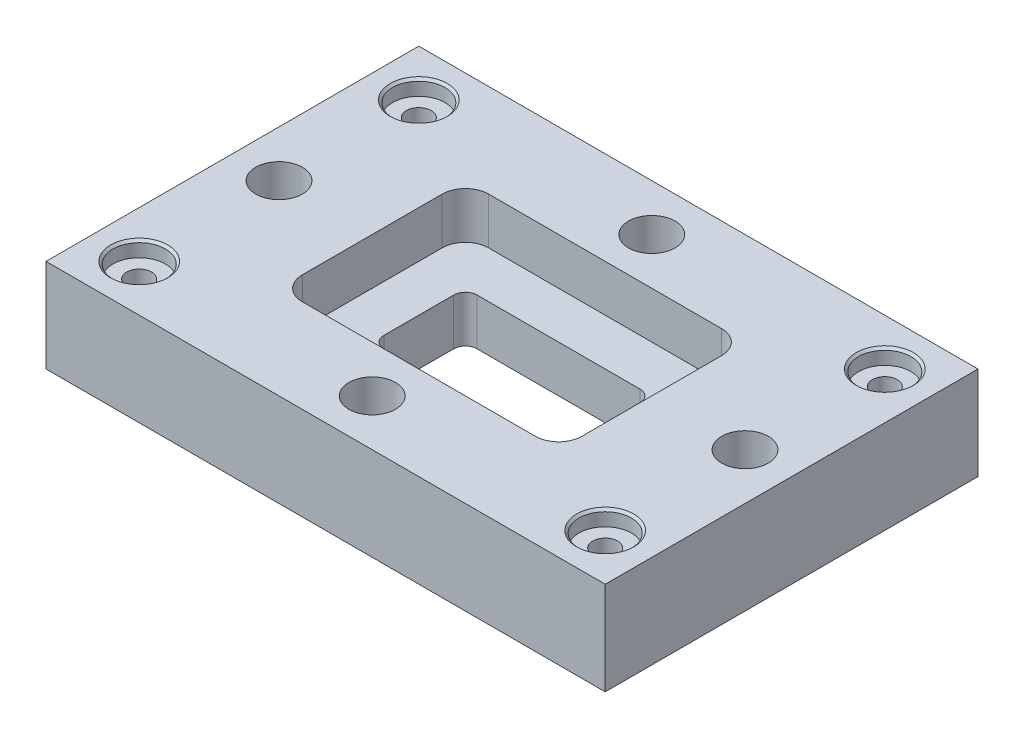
ISO-10303-21;
HEADER;
FILE_DESCRIPTION(('STEP AP214'),'2;1');
FILE_NAME('part.step','',(''),(''),'','','');
FILE_SCHEMA(('AUTOMOTIVE_DESIGN { 1 0 10303 214 1 1 1 1 }'));
ENDSEC;
DATA;
#1=APPLICATION_CONTEXT('core data for automotive mechanical design processes');
#2=APPLICATION_PROTOCOL_DEFINITION('international standard','automotive_design',2000,#1);
#3=PRODUCT_CONTEXT('',#1,'mechanical');
#4=PRODUCT('Part','Part','',(#3));
#5=PRODUCT_RELATED_PRODUCT_CATEGORY('part','',(#4));
#6=PRODUCT_DEFINITION_FORMATION('','',#4);
#7=PRODUCT_DEFINITION_CONTEXT('part definition',#1,'design');
#8=PRODUCT_DEFINITION('design','',#6,#7);
#9=PRODUCT_DEFINITION_SHAPE('','',#8);
#10=(LENGTH_UNIT() NAMED_UNIT(*) SI_UNIT(.MILLI.,.METRE.));
#11=(NAMED_UNIT(*) PLANE_ANGLE_UNIT() SI_UNIT($,.RADIAN.));
#12=(NAMED_UNIT(*) SI_UNIT($,.STERADIAN.) SOLID_ANGLE_UNIT());
#13=UNCERTAINTY_MEASURE_WITH_UNIT(LENGTH_MEASURE(1.E-05),#10,'distance_accuracy_value','');
#14=(GEOMETRIC_REPRESENTATION_CONTEXT(3) GLOBAL_UNCERTAINTY_ASSIGNED_CONTEXT((#13)) GLOBAL_UNIT_ASSIGNED_CONTEXT((#10,
#11,#12)) REPRESENTATION_CONTEXT('',''));
#15=CARTESIAN_POINT('',(0.,0.,0.));
#16=DIRECTION('',(0.,0.,1.));
#17=DIRECTION('',(1.,0.,0.));
#18=AXIS2_PLACEMENT_3D('',#15,#16,#17);
#19=CARTESIAN_POINT('',(0.,12.7,0.));
#20=DIRECTION('',(0.,-1.,0.));
#21=DIRECTION('',(0.,0.,-1.));
#22=AXIS2_PLACEMENT_3D('',#19,#20,#21);
#23=PLANE('',#22);
#24=DIRECTION('',(1.,0.,0.));
#25=VECTOR('',#24,1.);
#26=CARTESIAN_POINT('',(-38.1,12.7,25.4));
#27=LINE('',#26,#25);
#28=CARTESIAN_POINT('',(-31.75,12.7,25.4));
#29=VERTEX_POINT('',#28);
#30=CARTESIAN_POINT('',(31.75,12.7,25.4));
#31=VERTEX_POINT('',#30);
#32=EDGE_CURVE('E260',#29,#31,#27,.T.);
#33=ORIENTED_EDGE('',*,*,#32,.T.);
#34=CARTESIAN_POINT('',(31.75,12.7,19.05));
#35=DIRECTION('',(0.,-1.,0.));
#36=DIRECTION('',(0.,0.,-1.));
#37=AXIS2_PLACEMENT_3D('',#34,#35,#36);
#38=CIRCLE('',#37,6.35);
#39=CARTESIAN_POINT('',(38.1,12.7,19.05));
#40=VERTEX_POINT('',#39);
#41=EDGE_CURVE('E404',#31,#40,#38,.F.);
#42=ORIENTED_EDGE('',*,*,#41,.T.);
#43=DIRECTION('',(0.,0.,-1.));
#44=VECTOR('',#43,1.);
#45=CARTESIAN_POINT('',(38.1,12.7,25.4));
#46=LINE('',#45,#44);
#47=CARTESIAN_POINT('',(38.1,12.7,-19.05));
#48=VERTEX_POINT('',#47);
#49=EDGE_CURVE('E250',#40,#48,#46,.T.);
#50=ORIENTED_EDGE('',*,*,#49,.T.);
#51=CARTESIAN_POINT('',(31.75,12.7,-19.05));
#52=DIRECTION('',(0.,-1.,0.));
#53=DIRECTION('',(0.,0.,-1.));
#54=AXIS2_PLACEMENT_3D('',#51,#52,#53);
#55=CIRCLE('',#54,6.35);
#56=CARTESIAN_POINT('',(31.75,12.7,-25.4));
#57=VERTEX_POINT('',#56);
#58=EDGE_CURVE('E400',#48,#57,#55,.F.);
#59=ORIENTED_EDGE('',*,*,#58,.T.);
#60=DIRECTION('',(-1.,0.,0.));
#61=VECTOR('',#60,1.);
#62=CARTESIAN_POINT('',(-38.1,12.7,-25.4));
#63=LINE('',#62,#61);
#64=CARTESIAN_POINT('',(-31.75,12.7,-25.4));
#65=VERTEX_POINT('',#64);
#66=EDGE_CURVE('E253',#57,#65,#63,.T.);
#67=ORIENTED_EDGE('',*,*,#66,.T.);
#68=CARTESIAN_POINT('',(-31.75,12.7,-19.05));
#69=DIRECTION('',(0.,-1.,0.));
#70=DIRECTION('',(0.,0.,-1.));
#71=AXIS2_PLACEMENT_3D('',#68,#69,#70);
#72=CIRCLE('',#71,6.35);
#73=CARTESIAN_POINT('',(-38.1,12.7,-19.05));
#74=VERTEX_POINT('',#73);
#75=EDGE_CURVE('E398',#65,#74,#72,.F.);
#76=ORIENTED_EDGE('',*,*,#75,.T.);
#77=DIRECTION('',(0.,0.,1.));
#78=VECTOR('',#77,1.);
#79=CARTESIAN_POINT('',(-38.1,12.7,25.4));
#80=LINE('',#79,#78);
#81=CARTESIAN_POINT('',(-38.1,12.7,19.05));
#82=VERTEX_POINT('',#81);
#83=EDGE_CURVE('E257',#74,#82,#80,.T.);
#84=ORIENTED_EDGE('',*,*,#83,.T.);
#85=CARTESIAN_POINT('',(-31.75,12.7,19.05));
#86=DIRECTION('',(0.,-1.,0.));
#87=DIRECTION('',(0.,0.,-1.));
#88=AXIS2_PLACEMENT_3D('',#85,#86,#87);
#89=CIRCLE('',#88,6.35);
#90=EDGE_CURVE('E402',#82,#29,#89,.F.);
#91=ORIENTED_EDGE('',*,*,#90,.T.);
#92=EDGE_LOOP('',(#33,#42,#50,#59,#67,#76,#84,#91));
#93=FACE_BOUND('',#92,.T.);
#94=CARTESIAN_POINT('',(-22.225,12.7,-9.525));
#95=DIRECTION('',(0.,1.,0.));
#96=DIRECTION('',(0.,0.,-1.));
#97=AXIS2_PLACEMENT_3D('',#94,#95,#96);
#98=CIRCLE('',#97,3.175);
#99=CARTESIAN_POINT('',(-22.225,12.7,-12.7));
#100=VERTEX_POINT('',#99);
#101=CARTESIAN_POINT('',(-25.4,12.7,-9.52499999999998));
#102=VERTEX_POINT('',#101);
#103=EDGE_CURVE('E186',#100,#102,#98,.T.);
#104=ORIENTED_EDGE('',*,*,#103,.F.);
#105=DIRECTION('',(-1.,0.,0.));
#106=VECTOR('',#105,1.);
#107=CARTESIAN_POINT('',(-22.225,12.7,-12.7));
#108=LINE('',#107,#106);
#109=CARTESIAN_POINT('',(22.225,12.7,-12.7));
#110=VERTEX_POINT('',#109);
#111=EDGE_CURVE('E202',#110,#100,#108,.T.);
#112=ORIENTED_EDGE('',*,*,#111,.F.);
#113=CARTESIAN_POINT('',(22.225,12.7,-9.525));
#114=DIRECTION('',(0.,1.,0.));
#115=DIRECTION('',(0.,0.,-1.));
#116=AXIS2_PLACEMENT_3D('',#113,#114,#115);
#117=CIRCLE('',#116,3.175);
#118=CARTESIAN_POINT('',(25.4,12.7,-9.52499999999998));
#119=VERTEX_POINT('',#118);
#120=EDGE_CURVE('E57',#119,#110,#117,.T.);
#121=ORIENTED_EDGE('',*,*,#120,.F.);
#122=DIRECTION('',(0.,0.,-1.));
#123=VECTOR('',#122,1.);
#124=CARTESIAN_POINT('',(25.4,12.7,9.52499999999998));
#125=LINE('',#124,#123);
#126=CARTESIAN_POINT('',(25.4,12.7,9.52499999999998));
#127=VERTEX_POINT('',#126);
#128=EDGE_CURVE('E232',#127,#119,#125,.T.);
#129=ORIENTED_EDGE('',*,*,#128,.F.);
#130=CARTESIAN_POINT('',(22.225,12.7,9.525));
#131=DIRECTION('',(0.,1.,0.));
#132=DIRECTION('',(0.,0.,1.));
#133=AXIS2_PLACEMENT_3D('',#130,#131,#132);
#134=CIRCLE('',#133,3.175);
#135=CARTESIAN_POINT('',(22.225,12.7,12.7));
#136=VERTEX_POINT('',#135);
#137=EDGE_CURVE('E229',#136,#127,#134,.T.);
#138=ORIENTED_EDGE('',*,*,#137,.F.);
#139=DIRECTION('',(1.,0.,0.));
#140=VECTOR('',#139,1.);
#141=CARTESIAN_POINT('',(-22.225,12.7,12.7));
#142=LINE('',#141,#140);
#143=CARTESIAN_POINT('',(-22.225,12.7,12.7));
#144=VERTEX_POINT('',#143);
#145=EDGE_CURVE('E226',#144,#136,#142,.T.);
#146=ORIENTED_EDGE('',*,*,#145,.F.);
#147=CARTESIAN_POINT('',(-22.225,12.7,9.525));
#148=DIRECTION('',(0.,1.,0.));
#149=DIRECTION('',(0.,0.,-1.));
#150=AXIS2_PLACEMENT_3D('',#147,#148,#149);
#151=CIRCLE('',#150,3.175);
#152=CARTESIAN_POINT('',(-25.4,12.7,9.52499999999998));
#153=VERTEX_POINT('',#152);
#154=EDGE_CURVE('E223',#153,#144,#151,.T.);
#155=ORIENTED_EDGE('',*,*,#154,.F.);
#156=DIRECTION('',(0.,0.,1.));
#157=VECTOR('',#156,1.);
#158=CARTESIAN_POINT('',(-25.4,12.7,9.52499999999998));
#159=LINE('',#158,#157);
#160=EDGE_CURVE('E221',#102,#153,#159,.T.);
#161=ORIENTED_EDGE('',*,*,#160,.F.);
#162=EDGE_LOOP('',(#104,#112,#121,#129,#138,#146,#155,#161));
#163=FACE_BOUND('',#162,.T.);
#164=ADVANCED_FACE('F42',(#93,#163),#23,.F.);
#165=CARTESIAN_POINT('',(0.,25.4,0.));
#166=DIRECTION('',(0.,-1.,0.));
#167=DIRECTION('',(0.,0.,-1.));
#168=AXIS2_PLACEMENT_3D('',#165,#166,#167);
#169=PLANE('',#168);
#170=DIRECTION('',(-1.,0.,0.));
#171=VECTOR('',#170,1.);
#172=CARTESIAN_POINT('',(-38.1,25.4,-25.4));
#173=LINE('',#172,#171);
#174=CARTESIAN_POINT('',(31.75,25.4,-25.4));
#175=VERTEX_POINT('',#174);
#176=CARTESIAN_POINT('',(-31.75,25.4,-25.4));
#177=VERTEX_POINT('',#176);
#178=EDGE_CURVE('E266',#175,#177,#173,.T.);
#179=ORIENTED_EDGE('',*,*,#178,.F.);
#180=CARTESIAN_POINT('',(31.75,25.4,-19.05));
#181=DIRECTION('',(0.,-1.,0.));
#182=DIRECTION('',(0.,0.,-1.));
#183=AXIS2_PLACEMENT_3D('',#180,#181,#182);
#184=CIRCLE('',#183,6.35);
#185=CARTESIAN_POINT('',(38.1,25.4,-19.05));
#186=VERTEX_POINT('',#185);
#187=EDGE_CURVE('E50',#175,#186,#184,.T.);
#188=ORIENTED_EDGE('',*,*,#187,.T.);
#189=DIRECTION('',(0.,0.,-1.));
#190=VECTOR('',#189,1.);
#191=CARTESIAN_POINT('',(38.1,25.4,25.4));
#192=LINE('',#191,#190);
#193=CARTESIAN_POINT('',(38.1,25.4,19.05));
#194=VERTEX_POINT('',#193);
#195=EDGE_CURVE('E238',#194,#186,#192,.T.);
#196=ORIENTED_EDGE('',*,*,#195,.F.);
#197=CARTESIAN_POINT('',(31.75,25.4,19.05));
#198=DIRECTION('',(0.,-1.,0.));
#199=DIRECTION('',(0.,0.,-1.));
#200=AXIS2_PLACEMENT_3D('',#197,#198,#199);
#201=CIRCLE('',#200,6.35);
#202=CARTESIAN_POINT('',(31.75,25.4,25.4));
#203=VERTEX_POINT('',#202);
#204=EDGE_CURVE('E416',#194,#203,#201,.T.);
#205=ORIENTED_EDGE('',*,*,#204,.T.);
#206=DIRECTION('',(1.,0.,0.));
#207=VECTOR('',#206,1.);
#208=CARTESIAN_POINT('',(-38.1,25.4,25.4));
#209=LINE('',#208,#207);
#210=CARTESIAN_POINT('',(-31.75,25.4,25.4));
#211=VERTEX_POINT('',#210);
#212=EDGE_CURVE('E254',#211,#203,#209,.T.);
#213=ORIENTED_EDGE('',*,*,#212,.F.);
#214=CARTESIAN_POINT('',(-31.75,25.4,19.05));
#215=DIRECTION('',(0.,-1.,0.));
#216=DIRECTION('',(0.,0.,-1.));
#217=AXIS2_PLACEMENT_3D('',#214,#215,#216);
#218=CIRCLE('',#217,6.35);
#219=CARTESIAN_POINT('',(-38.1,25.4,19.05));
#220=VERTEX_POINT('',#219);
#221=EDGE_CURVE('E418',#211,#220,#218,.T.);
#222=ORIENTED_EDGE('',*,*,#221,.T.);
#223=DIRECTION('',(0.,0.,1.));
#224=VECTOR('',#223,1.);
#225=CARTESIAN_POINT('',(-38.1,25.4,25.4));
#226=LINE('',#225,#224);
#227=CARTESIAN_POINT('',(-38.1,25.4,-19.05));
#228=VERTEX_POINT('',#227);
#229=EDGE_CURVE('E269',#228,#220,#226,.T.);
#230=ORIENTED_EDGE('',*,*,#229,.F.);
#231=CARTESIAN_POINT('',(-31.75,25.4,-19.05));
#232=DIRECTION('',(0.,-1.,0.));
#233=DIRECTION('',(0.,0.,-1.));
#234=AXIS2_PLACEMENT_3D('',#231,#232,#233);
#235=CIRCLE('',#234,6.35);
#236=EDGE_CURVE('E12',#228,#177,#235,.T.);
#237=ORIENTED_EDGE('',*,*,#236,.T.);
#238=EDGE_LOOP('',(#179,#188,#196,#205,#213,#222,#230,#237));
#239=FACE_BOUND('',#238,.T.);
#240=CARTESIAN_POINT('',(-63.5,25.4,-38.1));
#241=DIRECTION('',(0.,1.,0.));
#242=DIRECTION('',(0.,0.,1.));
#243=AXIS2_PLACEMENT_3D('',#240,#241,#242);
#244=CIRCLE('',#243,7.77875);
#245=CARTESIAN_POINT('',(-63.5,25.4,-30.32125));
#246=VERTEX_POINT('',#245);
#247=EDGE_CURVE('E263',#246,#246,#244,.T.);
#248=ORIENTED_EDGE('',*,*,#247,.F.);
#249=EDGE_LOOP('',(#248));
#250=FACE_BOUND('',#249,.T.);
#251=CARTESIAN_POINT('',(63.5,25.4,-38.1));
#252=DIRECTION('',(0.,1.,0.));
#253=DIRECTION('',(0.,0.,1.));
#254=AXIS2_PLACEMENT_3D('',#251,#252,#253);
#255=CIRCLE('',#254,7.77875);
#256=CARTESIAN_POINT('',(63.5,25.4,-30.32125));
#257=VERTEX_POINT('',#256);
#258=EDGE_CURVE('E288',#257,#257,#255,.T.);
#259=ORIENTED_EDGE('',*,*,#258,.F.);
#260=EDGE_LOOP('',(#259));
#261=FACE_BOUND('',#260,.T.);
#262=CARTESIAN_POINT('',(63.5,25.4,38.1));
#263=DIRECTION('',(0.,1.,0.));
#264=DIRECTION('',(0.,0.,1.));
#265=AXIS2_PLACEMENT_3D('',#262,#263,#264);
#266=CIRCLE('',#265,7.77875);
#267=CARTESIAN_POINT('',(63.5,25.4,45.87875));
#268=VERTEX_POINT('',#267);
#269=EDGE_CURVE('E303',#268,#268,#266,.T.);
#270=ORIENTED_EDGE('',*,*,#269,.F.);
#271=EDGE_LOOP('',(#270));
#272=FACE_BOUND('',#271,.T.);
#273=CARTESIAN_POINT('',(-63.5,25.4,38.1));
#274=DIRECTION('',(0.,1.,0.));
#275=DIRECTION('',(0.,0.,1.));
#276=AXIS2_PLACEMENT_3D('',#273,#274,#275);
#277=CIRCLE('',#276,7.77875);
#278=CARTESIAN_POINT('',(-63.5,25.4,45.87875));
#279=VERTEX_POINT('',#278);
#280=EDGE_CURVE('E318',#279,#279,#277,.T.);
#281=ORIENTED_EDGE('',*,*,#280,.F.);
#282=EDGE_LOOP('',(#281));
#283=FACE_BOUND('',#282,.T.);
#284=DIRECTION('',(0.,0.,-1.));
#285=VECTOR('',#284,1.);
#286=CARTESIAN_POINT('',(76.2,25.4,50.8));
#287=LINE('',#286,#285);
#288=CARTESIAN_POINT('',(76.2,25.4,50.8));
#289=VERTEX_POINT('',#288);
#290=CARTESIAN_POINT('',(76.2,25.4,-50.8));
#291=VERTEX_POINT('',#290);
#292=EDGE_CURVE('E358',#289,#291,#287,.T.);
#293=ORIENTED_EDGE('',*,*,#292,.T.);
#294=DIRECTION('',(-1.,0.,0.));
#295=VECTOR('',#294,1.);
#296=CARTESIAN_POINT('',(-76.2,25.4,-50.8));
#297=LINE('',#296,#295);
#298=CARTESIAN_POINT('',(-76.2,25.4,-50.8));
#299=VERTEX_POINT('',#298);
#300=EDGE_CURVE('E361',#291,#299,#297,.T.);
#301=ORIENTED_EDGE('',*,*,#300,.T.);
#302=DIRECTION('',(0.,0.,1.));
#303=VECTOR('',#302,1.);
#304=CARTESIAN_POINT('',(-76.2,25.4,50.8));
#305=LINE('',#304,#303);
#306=CARTESIAN_POINT('',(-76.2,25.4,50.8));
#307=VERTEX_POINT('',#306);
#308=EDGE_CURVE('E364',#299,#307,#305,.T.);
#309=ORIENTED_EDGE('',*,*,#308,.T.);
#310=DIRECTION('',(1.,0.,0.));
#311=VECTOR('',#310,1.);
#312=CARTESIAN_POINT('',(-76.2,25.4,50.8));
#313=LINE('',#312,#311);
#314=EDGE_CURVE('E366',#307,#289,#313,.T.);
#315=ORIENTED_EDGE('',*,*,#314,.T.);
#316=EDGE_LOOP('',(#293,#301,#309,#315));
#317=FACE_BOUND('',#316,.T.);
#318=CARTESIAN_POINT('',(-63.5,25.4,0.));
#319=DIRECTION('',(0.,1.,0.));
#320=DIRECTION('',(0.,0.,1.));
#321=AXIS2_PLACEMENT_3D('',#318,#319,#320);
#322=CIRCLE('',#321,6.35);
#323=CARTESIAN_POINT('',(-63.5,25.4,6.35000000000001));
#324=VERTEX_POINT('',#323);
#325=EDGE_CURVE('E352',#324,#324,#322,.T.);
#326=ORIENTED_EDGE('',*,*,#325,.F.);
#327=EDGE_LOOP('',(#326));
#328=FACE_BOUND('',#327,.T.);
#329=CARTESIAN_POINT('',(63.5,25.4,0.));
#330=DIRECTION('',(0.,1.,0.));
#331=DIRECTION('',(0.,0.,1.));
#332=AXIS2_PLACEMENT_3D('',#329,#330,#331);
#333=CIRCLE('',#332,6.35);
#334=CARTESIAN_POINT('',(63.5,25.4,6.34999999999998));
#335=VERTEX_POINT('',#334);
#336=EDGE_CURVE('E346',#335,#335,#333,.T.);
#337=ORIENTED_EDGE('',*,*,#336,.F.);
#338=EDGE_LOOP('',(#337));
#339=FACE_BOUND('',#338,.T.);
#340=CARTESIAN_POINT('',(0.,25.4,38.1));
#341=DIRECTION('',(0.,1.,0.));
#342=DIRECTION('',(0.,0.,1.));
#343=AXIS2_PLACEMENT_3D('',#340,#341,#342);
#344=CIRCLE('',#343,6.35);
#345=CARTESIAN_POINT('',(0.,25.4,44.45));
#346=VERTEX_POINT('',#345);
#347=EDGE_CURVE('E340',#346,#346,#344,.T.);
#348=ORIENTED_EDGE('',*,*,#347,.F.);
#349=EDGE_LOOP('',(#348));
#350=FACE_BOUND('',#349,.T.);
#351=CARTESIAN_POINT('',(0.,25.4,-38.1));
#352=DIRECTION('',(0.,1.,0.));
#353=DIRECTION('',(0.,0.,1.));
#354=AXIS2_PLACEMENT_3D('',#351,#352,#353);
#355=CIRCLE('',#354,6.35);
#356=CARTESIAN_POINT('',(0.,25.4,-31.75));
#357=VERTEX_POINT('',#356);
#358=EDGE_CURVE('E334',#357,#357,#355,.T.);
#359=ORIENTED_EDGE('',*,*,#358,.F.);
#360=EDGE_LOOP('',(#359));
#361=FACE_BOUND('',#360,.T.);
#362=ADVANCED_FACE('F422',(#239,#250,#261,#272,#283,#317,#328,#339,#350,#361),#169,.F.);
#363=CARTESIAN_POINT('',(0.,0.,0.));
#364=DIRECTION('',(0.,-1.,0.));
#365=DIRECTION('',(0.,0.,-1.));
#366=AXIS2_PLACEMENT_3D('',#363,#364,#365);
#367=PLANE('',#366);
#368=CARTESIAN_POINT('',(-22.225,0.,-9.525));
#369=DIRECTION('',(0.,1.,0.));
#370=DIRECTION('',(0.,0.,-1.));
#371=AXIS2_PLACEMENT_3D('',#368,#369,#370);
#372=CIRCLE('',#371,3.175);
#373=CARTESIAN_POINT('',(-22.225,0.,-12.7));
#374=VERTEX_POINT('',#373);
#375=CARTESIAN_POINT('',(-25.4,0.,-9.52499999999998));
#376=VERTEX_POINT('',#375);
#377=EDGE_CURVE('E183',#374,#376,#372,.T.);
#378=ORIENTED_EDGE('',*,*,#377,.T.);
#379=DIRECTION('',(0.,0.,1.));
#380=VECTOR('',#379,1.);
#381=CARTESIAN_POINT('',(-25.4,0.,9.52499999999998));
#382=LINE('',#381,#380);
#383=CARTESIAN_POINT('',(-25.4,0.,9.52499999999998));
#384=VERTEX_POINT('',#383);
#385=EDGE_CURVE('E194',#376,#384,#382,.T.);
#386=ORIENTED_EDGE('',*,*,#385,.T.);
#387=CARTESIAN_POINT('',(-22.225,0.,9.525));
#388=DIRECTION('',(0.,1.,0.));
#389=DIRECTION('',(0.,0.,-1.));
#390=AXIS2_PLACEMENT_3D('',#387,#388,#389);
#391=CIRCLE('',#390,3.175);
#392=CARTESIAN_POINT('',(-22.225,0.,12.7));
#393=VERTEX_POINT('',#392);
#394=EDGE_CURVE('E65',#384,#393,#391,.T.);
#395=ORIENTED_EDGE('',*,*,#394,.T.);
#396=DIRECTION('',(1.,0.,0.));
#397=VECTOR('',#396,1.);
#398=CARTESIAN_POINT('',(-22.225,0.,12.7));
#399=LINE('',#398,#397);
#400=CARTESIAN_POINT('',(22.225,0.,12.7));
#401=VERTEX_POINT('',#400);
#402=EDGE_CURVE('E208',#393,#401,#399,.T.);
#403=ORIENTED_EDGE('',*,*,#402,.T.);
#404=CARTESIAN_POINT('',(22.225,0.,9.525));
#405=DIRECTION('',(0.,1.,0.));
#406=DIRECTION('',(0.,0.,1.));
#407=AXIS2_PLACEMENT_3D('',#404,#405,#406);
#408=CIRCLE('',#407,3.175);
#409=CARTESIAN_POINT('',(25.4,0.,9.52499999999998));
#410=VERTEX_POINT('',#409);
#411=EDGE_CURVE('E211',#401,#410,#408,.T.);
#412=ORIENTED_EDGE('',*,*,#411,.T.);
#413=DIRECTION('',(0.,0.,-1.));
#414=VECTOR('',#413,1.);
#415=CARTESIAN_POINT('',(25.4,0.,9.52499999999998));
#416=LINE('',#415,#414);
#417=CARTESIAN_POINT('',(25.4,0.,-9.52499999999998));
#418=VERTEX_POINT('',#417);
#419=EDGE_CURVE('E214',#410,#418,#416,.T.);
#420=ORIENTED_EDGE('',*,*,#419,.T.);
#421=CARTESIAN_POINT('',(22.225,0.,-9.525));
#422=DIRECTION('',(0.,1.,0.));
#423=DIRECTION('',(0.,0.,-1.));
#424=AXIS2_PLACEMENT_3D('',#421,#422,#423);
#425=CIRCLE('',#424,3.175);
#426=CARTESIAN_POINT('',(22.225,0.,-12.7));
#427=VERTEX_POINT('',#426);
#428=EDGE_CURVE('E217',#418,#427,#425,.T.);
#429=ORIENTED_EDGE('',*,*,#428,.T.);
#430=DIRECTION('',(-1.,0.,0.));
#431=VECTOR('',#430,1.);
#432=CARTESIAN_POINT('',(-22.225,0.,-12.7));
#433=LINE('',#432,#431);
#434=EDGE_CURVE('E191',#427,#374,#433,.T.);
#435=ORIENTED_EDGE('',*,*,#434,.T.);
#436=EDGE_LOOP('',(#378,#386,#395,#403,#412,#420,#429,#435));
#437=FACE_BOUND('',#436,.T.);
#438=CARTESIAN_POINT('',(-63.5,0.,-38.1));
#439=DIRECTION('',(0.,1.,0.));
#440=DIRECTION('',(0.,0.,1.));
#441=AXIS2_PLACEMENT_3D('',#438,#439,#440);
#442=CIRCLE('',#441,3.37819999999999);
#443=CARTESIAN_POINT('',(-63.5,0.,-34.7218));
#444=VERTEX_POINT('',#443);
#445=EDGE_CURVE('E285',#444,#444,#442,.T.);
#446=ORIENTED_EDGE('',*,*,#445,.T.);
#447=EDGE_LOOP('',(#446));
#448=FACE_BOUND('',#447,.T.);
#449=CARTESIAN_POINT('',(63.5,0.,-38.1));
#450=DIRECTION('',(0.,1.,0.));
#451=DIRECTION('',(0.,0.,1.));
#452=AXIS2_PLACEMENT_3D('',#449,#450,#451);
#453=CIRCLE('',#452,3.3782);
#454=CARTESIAN_POINT('',(63.5,0.,-34.7218));
#455=VERTEX_POINT('',#454);
#456=EDGE_CURVE('E300',#455,#455,#453,.T.);
#457=ORIENTED_EDGE('',*,*,#456,.T.);
#458=EDGE_LOOP('',(#457));
#459=FACE_BOUND('',#458,.T.);
#460=CARTESIAN_POINT('',(63.5,0.,38.1));
#461=DIRECTION('',(0.,1.,0.));
#462=DIRECTION('',(0.,0.,1.));
#463=AXIS2_PLACEMENT_3D('',#460,#461,#462);
#464=CIRCLE('',#463,3.3782);
#465=CARTESIAN_POINT('',(63.5,0.,41.4782));
#466=VERTEX_POINT('',#465);
#467=EDGE_CURVE('E315',#466,#466,#464,.T.);
#468=ORIENTED_EDGE('',*,*,#467,.T.);
#469=EDGE_LOOP('',(#468));
#470=FACE_BOUND('',#469,.T.);
#471=CARTESIAN_POINT('',(-63.5,0.,38.1));
#472=DIRECTION('',(0.,1.,0.));
#473=DIRECTION('',(0.,0.,1.));
#474=AXIS2_PLACEMENT_3D('',#471,#472,#473);
#475=CIRCLE('',#474,3.37819999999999);
#476=CARTESIAN_POINT('',(-63.5,0.,41.4782));
#477=VERTEX_POINT('',#476);
#478=EDGE_CURVE('E330',#477,#477,#475,.T.);
#479=ORIENTED_EDGE('',*,*,#478,.T.);
#480=EDGE_LOOP('',(#479));
#481=FACE_BOUND('',#480,.T.);
#482=CARTESIAN_POINT('',(0.,0.,38.1));
#483=DIRECTION('',(0.,1.,0.));
#484=DIRECTION('',(0.,0.,1.));
#485=AXIS2_PLACEMENT_3D('',#482,#483,#484);
#486=CIRCLE('',#485,6.35);
#487=CARTESIAN_POINT('',(0.,0.,44.45));
#488=VERTEX_POINT('',#487);
#489=EDGE_CURVE('E337',#488,#488,#486,.T.);
#490=ORIENTED_EDGE('',*,*,#489,.T.);
#491=EDGE_LOOP('',(#490));
#492=FACE_BOUND('',#491,.T.);
#493=CARTESIAN_POINT('',(-63.5,0.,0.));
#494=DIRECTION('',(0.,1.,0.));
#495=DIRECTION('',(0.,0.,1.));
#496=AXIS2_PLACEMENT_3D('',#493,#494,#495);
#497=CIRCLE('',#496,6.35);
#498=CARTESIAN_POINT('',(-63.5,0.,6.35000000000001));
#499=VERTEX_POINT('',#498);
#500=EDGE_CURVE('E349',#499,#499,#497,.T.);
#501=ORIENTED_EDGE('',*,*,#500,.T.);
#502=EDGE_LOOP('',(#501));
#503=FACE_BOUND('',#502,.T.);
#504=DIRECTION('',(0.,0.,-1.));
#505=VECTOR('',#504,1.);
#506=CARTESIAN_POINT('',(76.2,0.,50.8));
#507=LINE('',#506,#505);
#508=CARTESIAN_POINT('',(76.2,0.,50.8));
#509=VERTEX_POINT('',#508);
#510=CARTESIAN_POINT('',(76.2,0.,-50.8));
#511=VERTEX_POINT('',#510);
#512=EDGE_CURVE('E355',#509,#511,#507,.T.);
#513=ORIENTED_EDGE('',*,*,#512,.F.);
#514=DIRECTION('',(1.,0.,0.));
#515=VECTOR('',#514,1.);
#516=CARTESIAN_POINT('',(-76.2,0.,50.8));
#517=LINE('',#516,#515);
#518=CARTESIAN_POINT('',(-76.2,0.,50.8));
#519=VERTEX_POINT('',#518);
#520=EDGE_CURVE('E362',#519,#509,#517,.T.);
#521=ORIENTED_EDGE('',*,*,#520,.F.);
#522=DIRECTION('',(0.,0.,1.));
#523=VECTOR('',#522,1.);
#524=CARTESIAN_POINT('',(-76.2,0.,50.8));
#525=LINE('',#524,#523);
#526=CARTESIAN_POINT('',(-76.2,0.,-50.8));
#527=VERTEX_POINT('',#526);
#528=EDGE_CURVE('E373',#527,#519,#525,.T.);
#529=ORIENTED_EDGE('',*,*,#528,.F.);
#530=DIRECTION('',(-1.,0.,0.));
#531=VECTOR('',#530,1.);
#532=CARTESIAN_POINT('',(-76.2,0.,-50.8));
#533=LINE('',#532,#531);
#534=EDGE_CURVE('E371',#511,#527,#533,.T.);
#535=ORIENTED_EDGE('',*,*,#534,.F.);
#536=EDGE_LOOP('',(#513,#521,#529,#535));
#537=FACE_BOUND('',#536,.T.);
#538=CARTESIAN_POINT('',(63.5,0.,0.));
#539=DIRECTION('',(0.,1.,0.));
#540=DIRECTION('',(0.,0.,1.));
#541=AXIS2_PLACEMENT_3D('',#538,#539,#540);
#542=CIRCLE('',#541,6.35);
#543=CARTESIAN_POINT('',(63.5,0.,6.34999999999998));
#544=VERTEX_POINT('',#543);
#545=EDGE_CURVE('E343',#544,#544,#542,.T.);
#546=ORIENTED_EDGE('',*,*,#545,.T.);
#547=EDGE_LOOP('',(#546));
#548=FACE_BOUND('',#547,.T.);
#549=CARTESIAN_POINT('',(0.,0.,-38.1));
#550=DIRECTION('',(0.,1.,0.));
#551=DIRECTION('',(0.,0.,1.));
#552=AXIS2_PLACEMENT_3D('',#549,#550,#551);
#553=CIRCLE('',#552,6.35);
#554=CARTESIAN_POINT('',(0.,0.,-31.75));
#555=VERTEX_POINT('',#554);
#556=EDGE_CURVE('E333',#555,#555,#553,.T.);
#557=ORIENTED_EDGE('',*,*,#556,.T.);
#558=EDGE_LOOP('',(#557));
#559=FACE_BOUND('',#558,.T.);
#560=ADVANCED_FACE('F198',(#437,#448,#459,#470,#481,#492,#503,#537,#548,#559),#367,.T.);
#561=CARTESIAN_POINT('',(76.2,25.4,50.8));
#562=DIRECTION('',(-1.,0.,0.));
#563=DIRECTION('',(0.,0.,1.));
#564=AXIS2_PLACEMENT_3D('',#561,#562,#563);
#565=PLANE('',#564);
#566=ORIENTED_EDGE('',*,*,#512,.T.);
#567=DIRECTION('',(0.,-1.,0.));
#568=VECTOR('',#567,1.);
#569=CARTESIAN_POINT('',(76.2,25.4,-50.8));
#570=LINE('',#569,#568);
#571=EDGE_CURVE('E385',#291,#511,#570,.T.);
#572=ORIENTED_EDGE('',*,*,#571,.F.);
#573=ORIENTED_EDGE('',*,*,#292,.F.);
#574=DIRECTION('',(0.,-1.,0.));
#575=VECTOR('',#574,1.);
#576=CARTESIAN_POINT('',(76.2,25.4,50.8));
#577=LINE('',#576,#575);
#578=EDGE_CURVE('E368',#289,#509,#577,.T.);
#579=ORIENTED_EDGE('',*,*,#578,.T.);
#580=EDGE_LOOP('',(#566,#572,#573,#579));
#581=FACE_BOUND('',#580,.T.);
#582=ADVANCED_FACE('F566',(#581),#565,.F.);
#583=CARTESIAN_POINT('',(-76.2,25.4,-50.8));
#584=DIRECTION('',(0.,0.,1.));
#585=DIRECTION('',(1.,0.,0.));
#586=AXIS2_PLACEMENT_3D('',#583,#584,#585);
#587=PLANE('',#586);
#588=ORIENTED_EDGE('',*,*,#534,.T.);
#589=DIRECTION('',(0.,-1.,0.));
#590=VECTOR('',#589,1.);
#591=CARTESIAN_POINT('',(-76.2,25.4,-50.8));
#592=LINE('',#591,#590);
#593=EDGE_CURVE('E380',#299,#527,#592,.T.);
#594=ORIENTED_EDGE('',*,*,#593,.F.);
#595=ORIENTED_EDGE('',*,*,#300,.F.);
#596=ORIENTED_EDGE('',*,*,#571,.T.);
#597=EDGE_LOOP('',(#588,#594,#595,#596));
#598=FACE_BOUND('',#597,.T.);
#599=ADVANCED_FACE('F573',(#598),#587,.F.);
#600=CARTESIAN_POINT('',(-76.2,25.4,50.8));
#601=DIRECTION('',(1.,0.,0.));
#602=DIRECTION('',(0.,0.,-1.));
#603=AXIS2_PLACEMENT_3D('',#600,#601,#602);
#604=PLANE('',#603);
#605=ORIENTED_EDGE('',*,*,#528,.T.);
#606=DIRECTION('',(0.,-1.,0.));
#607=VECTOR('',#606,1.);
#608=CARTESIAN_POINT('',(-76.2,25.4,50.8));
#609=LINE('',#608,#607);
#610=EDGE_CURVE('E378',#307,#519,#609,.T.);
#611=ORIENTED_EDGE('',*,*,#610,.F.);
#612=ORIENTED_EDGE('',*,*,#308,.F.);
#613=ORIENTED_EDGE('',*,*,#593,.T.);
#614=EDGE_LOOP('',(#605,#611,#612,#613));
#615=FACE_BOUND('',#614,.T.);
#616=ADVANCED_FACE('F569',(#615),#604,.F.);
#617=CARTESIAN_POINT('',(-76.2,25.4,50.8));
#618=DIRECTION('',(0.,0.,-1.));
#619=DIRECTION('',(-1.,0.,0.));
#620=AXIS2_PLACEMENT_3D('',#617,#618,#619);
#621=PLANE('',#620);
#622=ORIENTED_EDGE('',*,*,#520,.T.);
#623=ORIENTED_EDGE('',*,*,#578,.F.);
#624=ORIENTED_EDGE('',*,*,#314,.F.);
#625=ORIENTED_EDGE('',*,*,#610,.T.);
#626=EDGE_LOOP('',(#622,#623,#624,#625));
#627=FACE_BOUND('',#626,.T.);
#628=ADVANCED_FACE('F561',(#627),#621,.F.);
#629=CARTESIAN_POINT('',(-63.5,25.4,0.));
#630=DIRECTION('',(0.,-1.,0.));
#631=DIRECTION('',(0.,0.,-1.));
#632=AXIS2_PLACEMENT_3D('',#629,#630,#631);
#633=CYLINDRICAL_SURFACE('',#632,6.35);
#634=ORIENTED_EDGE('',*,*,#325,.T.);
#635=EDGE_LOOP('',(#634));
#636=FACE_BOUND('',#635,.T.);
#637=ORIENTED_EDGE('',*,*,#500,.F.);
#638=EDGE_LOOP('',(#637));
#639=FACE_BOUND('',#638,.T.);
#640=ADVANCED_FACE('F558',(#636,#639),#633,.F.);
#641=CARTESIAN_POINT('',(63.5,25.4,0.));
#642=DIRECTION('',(0.,-1.,0.));
#643=DIRECTION('',(0.,0.,-1.));
#644=AXIS2_PLACEMENT_3D('',#641,#642,#643);
#645=CYLINDRICAL_SURFACE('',#644,6.35);
#646=ORIENTED_EDGE('',*,*,#336,.T.);
#647=EDGE_LOOP('',(#646));
#648=FACE_BOUND('',#647,.T.);
#649=ORIENTED_EDGE('',*,*,#545,.F.);
#650=EDGE_LOOP('',(#649));
#651=FACE_BOUND('',#650,.T.);
#652=ADVANCED_FACE('F554',(#648,#651),#645,.F.);
#653=CARTESIAN_POINT('',(0.,25.4,38.1));
#654=DIRECTION('',(0.,-1.,0.));
#655=DIRECTION('',(0.,0.,-1.));
#656=AXIS2_PLACEMENT_3D('',#653,#654,#655);
#657=CYLINDRICAL_SURFACE('',#656,6.35);
#658=ORIENTED_EDGE('',*,*,#347,.T.);
#659=EDGE_LOOP('',(#658));
#660=FACE_BOUND('',#659,.T.);
#661=ORIENTED_EDGE('',*,*,#489,.F.);
#662=EDGE_LOOP('',(#661));
#663=FACE_BOUND('',#662,.T.);
#664=ADVANCED_FACE('F550',(#660,#663),#657,.F.);
#665=CARTESIAN_POINT('',(0.,25.4,-38.1));
#666=DIRECTION('',(0.,-1.,0.));
#667=DIRECTION('',(0.,0.,-1.));
#668=AXIS2_PLACEMENT_3D('',#665,#666,#667);
#669=CYLINDRICAL_SURFACE('',#668,6.35);
#670=ORIENTED_EDGE('',*,*,#358,.T.);
#671=EDGE_LOOP('',(#670));
#672=FACE_BOUND('',#671,.T.);
#673=ORIENTED_EDGE('',*,*,#556,.F.);
#674=EDGE_LOOP('',(#673));
#675=FACE_BOUND('',#674,.T.);
#676=ADVANCED_FACE('F546',(#672,#675),#669,.F.);
#677=CARTESIAN_POINT('',(-63.5,25.4,38.1));
#678=DIRECTION('',(0.,1.,0.));
#679=DIRECTION('',(0.,0.,1.));
#680=AXIS2_PLACEMENT_3D('',#677,#678,#679);
#681=CYLINDRICAL_SURFACE('',#680,3.37819999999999);
#682=ORIENTED_EDGE('',*,*,#478,.F.);
#683=EDGE_LOOP('',(#682));
#684=FACE_BOUND('',#683,.T.);
#685=CARTESIAN_POINT('',(-63.5,21.209,38.1));
#686=DIRECTION('',(0.,1.,0.));
#687=DIRECTION('',(0.,0.,1.));
#688=AXIS2_PLACEMENT_3D('',#685,#686,#687);
#689=CIRCLE('',#688,3.3782);
#690=CARTESIAN_POINT('',(-63.5,21.209,41.4782));
#691=VERTEX_POINT('',#690);
#692=EDGE_CURVE('E327',#691,#691,#689,.T.);
#693=ORIENTED_EDGE('',*,*,#692,.T.);
#694=EDGE_LOOP('',(#693));
#695=FACE_BOUND('',#694,.T.);
#696=ADVANCED_FACE('F542',(#684,#695),#681,.F.);
#697=CARTESIAN_POINT('',(-56.35625,21.209,38.1));
#698=DIRECTION('',(0.,-1.,0.));
#699=DIRECTION('',(0.,0.,-1.));
#700=AXIS2_PLACEMENT_3D('',#697,#698,#699);
#701=PLANE('',#700);
#702=ORIENTED_EDGE('',*,*,#692,.F.);
#703=EDGE_LOOP('',(#702));
#704=FACE_BOUND('',#703,.T.);
#705=CARTESIAN_POINT('',(-63.5,21.209,38.1));
#706=DIRECTION('',(0.,1.,0.));
#707=DIRECTION('',(0.,0.,1.));
#708=AXIS2_PLACEMENT_3D('',#705,#706,#707);
#709=CIRCLE('',#708,7.14375);
#710=CARTESIAN_POINT('',(-63.5,21.209,45.24375));
#711=VERTEX_POINT('',#710);
#712=EDGE_CURVE('E324',#711,#711,#709,.T.);
#713=ORIENTED_EDGE('',*,*,#712,.T.);
#714=EDGE_LOOP('',(#713));
#715=FACE_BOUND('',#714,.T.);
#716=ADVANCED_FACE('F538',(#704,#715),#701,.F.);
#717=CARTESIAN_POINT('',(-63.5,25.4,38.1));
#718=DIRECTION('',(0.,1.,0.));
#719=DIRECTION('',(0.,0.,1.));
#720=AXIS2_PLACEMENT_3D('',#717,#718,#719);
#721=CYLINDRICAL_SURFACE('',#720,7.14375);
#722=ORIENTED_EDGE('',*,*,#712,.F.);
#723=EDGE_LOOP('',(#722));
#724=FACE_BOUND('',#723,.T.);
#725=CARTESIAN_POINT('',(-63.5,24.765,38.1));
#726=DIRECTION('',(0.,1.,0.));
#727=DIRECTION('',(0.,0.,1.));
#728=AXIS2_PLACEMENT_3D('',#725,#726,#727);
#729=CIRCLE('',#728,7.14375);
#730=CARTESIAN_POINT('',(-63.5,24.765,45.24375));
#731=VERTEX_POINT('',#730);
#732=EDGE_CURVE('E321',#731,#731,#729,.T.);
#733=ORIENTED_EDGE('',*,*,#732,.T.);
#734=EDGE_LOOP('',(#733));
#735=FACE_BOUND('',#734,.T.);
#736=ADVANCED_FACE('F534',(#724,#735),#721,.F.);
#737=CARTESIAN_POINT('',(-63.5,25.4,38.1));
#738=DIRECTION('',(0.,1.,0.));
#739=DIRECTION('',(0.,0.,1.));
#740=AXIS2_PLACEMENT_3D('',#737,#738,#739);
#741=CONICAL_SURFACE('',#740,7.77875,0.785398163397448);
#742=ORIENTED_EDGE('',*,*,#732,.F.);
#743=EDGE_LOOP('',(#742));
#744=FACE_BOUND('',#743,.T.);
#745=ORIENTED_EDGE('',*,*,#280,.T.);
#746=EDGE_LOOP('',(#745));
#747=FACE_BOUND('',#746,.T.);
#748=ADVANCED_FACE('F530',(#744,#747),#741,.F.);
#749=CARTESIAN_POINT('',(63.5,25.4,38.1));
#750=DIRECTION('',(0.,1.,0.));
#751=DIRECTION('',(0.,0.,1.));
#752=AXIS2_PLACEMENT_3D('',#749,#750,#751);
#753=CYLINDRICAL_SURFACE('',#752,3.3782);
#754=ORIENTED_EDGE('',*,*,#467,.F.);
#755=EDGE_LOOP('',(#754));
#756=FACE_BOUND('',#755,.T.);
#757=CARTESIAN_POINT('',(63.5,21.209,38.1));
#758=DIRECTION('',(0.,1.,0.));
#759=DIRECTION('',(0.,0.,1.));
#760=AXIS2_PLACEMENT_3D('',#757,#758,#759);
#761=CIRCLE('',#760,3.3782);
#762=CARTESIAN_POINT('',(63.5,21.209,41.4782));
#763=VERTEX_POINT('',#762);
#764=EDGE_CURVE('E312',#763,#763,#761,.T.);
#765=ORIENTED_EDGE('',*,*,#764,.T.);
#766=EDGE_LOOP('',(#765));
#767=FACE_BOUND('',#766,.T.);
#768=ADVANCED_FACE('F526',(#756,#767),#753,.F.);
#769=CARTESIAN_POINT('',(70.64375,21.209,38.1));
#770=DIRECTION('',(0.,-1.,0.));
#771=DIRECTION('',(0.,0.,-1.));
#772=AXIS2_PLACEMENT_3D('',#769,#770,#771);
#773=PLANE('',#772);
#774=ORIENTED_EDGE('',*,*,#764,.F.);
#775=EDGE_LOOP('',(#774));
#776=FACE_BOUND('',#775,.T.);
#777=CARTESIAN_POINT('',(63.5,21.209,38.1));
#778=DIRECTION('',(0.,1.,0.));
#779=DIRECTION('',(0.,0.,1.));
#780=AXIS2_PLACEMENT_3D('',#777,#778,#779);
#781=CIRCLE('',#780,7.14374999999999);
#782=CARTESIAN_POINT('',(63.5,21.209,45.24375));
#783=VERTEX_POINT('',#782);
#784=EDGE_CURVE('E309',#783,#783,#781,.T.);
#785=ORIENTED_EDGE('',*,*,#784,.T.);
#786=EDGE_LOOP('',(#785));
#787=FACE_BOUND('',#786,.T.);
#788=ADVANCED_FACE('F522',(#776,#787),#773,.F.);
#789=CARTESIAN_POINT('',(63.5,25.4,38.1));
#790=DIRECTION('',(0.,1.,0.));
#791=DIRECTION('',(0.,0.,1.));
#792=AXIS2_PLACEMENT_3D('',#789,#790,#791);
#793=CYLINDRICAL_SURFACE('',#792,7.14375);
#794=ORIENTED_EDGE('',*,*,#784,.F.);
#795=EDGE_LOOP('',(#794));
#796=FACE_BOUND('',#795,.T.);
#797=CARTESIAN_POINT('',(63.5,24.765,38.1));
#798=DIRECTION('',(0.,1.,0.));
#799=DIRECTION('',(0.,0.,1.));
#800=AXIS2_PLACEMENT_3D('',#797,#798,#799);
#801=CIRCLE('',#800,7.14375);
#802=CARTESIAN_POINT('',(63.5,24.765,45.24375));
#803=VERTEX_POINT('',#802);
#804=EDGE_CURVE('E306',#803,#803,#801,.T.);
#805=ORIENTED_EDGE('',*,*,#804,.T.);
#806=EDGE_LOOP('',(#805));
#807=FACE_BOUND('',#806,.T.);
#808=ADVANCED_FACE('F518',(#796,#807),#793,.F.);
#809=CARTESIAN_POINT('',(63.5,25.4,38.1));
#810=DIRECTION('',(0.,1.,0.));
#811=DIRECTION('',(0.,0.,1.));
#812=AXIS2_PLACEMENT_3D('',#809,#810,#811);
#813=CONICAL_SURFACE('',#812,7.77875,0.785398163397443);
#814=ORIENTED_EDGE('',*,*,#804,.F.);
#815=EDGE_LOOP('',(#814));
#816=FACE_BOUND('',#815,.T.);
#817=ORIENTED_EDGE('',*,*,#269,.T.);
#818=EDGE_LOOP('',(#817));
#819=FACE_BOUND('',#818,.T.);
#820=ADVANCED_FACE('F514',(#816,#819),#813,.F.);
#821=CARTESIAN_POINT('',(63.5,25.4,-38.1));
#822=DIRECTION('',(0.,1.,0.));
#823=DIRECTION('',(0.,0.,1.));
#824=AXIS2_PLACEMENT_3D('',#821,#822,#823);
#825=CYLINDRICAL_SURFACE('',#824,3.3782);
#826=ORIENTED_EDGE('',*,*,#456,.F.);
#827=EDGE_LOOP('',(#826));
#828=FACE_BOUND('',#827,.T.);
#829=CARTESIAN_POINT('',(63.5,21.209,-38.1));
#830=DIRECTION('',(0.,1.,0.));
#831=DIRECTION('',(0.,0.,1.));
#832=AXIS2_PLACEMENT_3D('',#829,#830,#831);
#833=CIRCLE('',#832,3.3782);
#834=CARTESIAN_POINT('',(63.5,21.209,-34.7218));
#835=VERTEX_POINT('',#834);
#836=EDGE_CURVE('E297',#835,#835,#833,.T.);
#837=ORIENTED_EDGE('',*,*,#836,.T.);
#838=EDGE_LOOP('',(#837));
#839=FACE_BOUND('',#838,.T.);
#840=ADVANCED_FACE('F510',(#828,#839),#825,.F.);
#841=CARTESIAN_POINT('',(70.64375,21.209,-38.1));
#842=DIRECTION('',(0.,-1.,0.));
#843=DIRECTION('',(0.,0.,-1.));
#844=AXIS2_PLACEMENT_3D('',#841,#842,#843);
#845=PLANE('',#844);
#846=ORIENTED_EDGE('',*,*,#836,.F.);
#847=EDGE_LOOP('',(#846));
#848=FACE_BOUND('',#847,.T.);
#849=CARTESIAN_POINT('',(63.5,21.209,-38.1));
#850=DIRECTION('',(0.,1.,0.));
#851=DIRECTION('',(0.,0.,1.));
#852=AXIS2_PLACEMENT_3D('',#849,#850,#851);
#853=CIRCLE('',#852,7.14374999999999);
#854=CARTESIAN_POINT('',(63.5,21.209,-30.95625));
#855=VERTEX_POINT('',#854);
#856=EDGE_CURVE('E294',#855,#855,#853,.T.);
#857=ORIENTED_EDGE('',*,*,#856,.T.);
#858=EDGE_LOOP('',(#857));
#859=FACE_BOUND('',#858,.T.);
#860=ADVANCED_FACE('F506',(#848,#859),#845,.F.);
#861=CARTESIAN_POINT('',(63.5,25.4,-38.1));
#862=DIRECTION('',(0.,1.,0.));
#863=DIRECTION('',(0.,0.,1.));
#864=AXIS2_PLACEMENT_3D('',#861,#862,#863);
#865=CYLINDRICAL_SURFACE('',#864,7.14375);
#866=ORIENTED_EDGE('',*,*,#856,.F.);
#867=EDGE_LOOP('',(#866));
#868=FACE_BOUND('',#867,.T.);
#869=CARTESIAN_POINT('',(63.5,24.765,-38.1));
#870=DIRECTION('',(0.,1.,0.));
#871=DIRECTION('',(0.,0.,1.));
#872=AXIS2_PLACEMENT_3D('',#869,#870,#871);
#873=CIRCLE('',#872,7.14375);
#874=CARTESIAN_POINT('',(63.5,24.765,-30.95625));
#875=VERTEX_POINT('',#874);
#876=EDGE_CURVE('E291',#875,#875,#873,.T.);
#877=ORIENTED_EDGE('',*,*,#876,.T.);
#878=EDGE_LOOP('',(#877));
#879=FACE_BOUND('',#878,.T.);
#880=ADVANCED_FACE('F502',(#868,#879),#865,.F.);
#881=CARTESIAN_POINT('',(63.5,25.4,-38.1));
#882=DIRECTION('',(0.,1.,0.));
#883=DIRECTION('',(0.,0.,1.));
#884=AXIS2_PLACEMENT_3D('',#881,#882,#883);
#885=CONICAL_SURFACE('',#884,7.77875,0.785398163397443);
#886=ORIENTED_EDGE('',*,*,#876,.F.);
#887=EDGE_LOOP('',(#886));
#888=FACE_BOUND('',#887,.T.);
#889=ORIENTED_EDGE('',*,*,#258,.T.);
#890=EDGE_LOOP('',(#889));
#891=FACE_BOUND('',#890,.T.);
#892=ADVANCED_FACE('F498',(#888,#891),#885,.F.);
#893=CARTESIAN_POINT('',(-63.5,25.4,-38.1));
#894=DIRECTION('',(0.,1.,0.));
#895=DIRECTION('',(0.,0.,1.));
#896=AXIS2_PLACEMENT_3D('',#893,#894,#895);
#897=CYLINDRICAL_SURFACE('',#896,3.37819999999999);
#898=ORIENTED_EDGE('',*,*,#445,.F.);
#899=EDGE_LOOP('',(#898));
#900=FACE_BOUND('',#899,.T.);
#901=CARTESIAN_POINT('',(-63.5,21.209,-38.1));
#902=DIRECTION('',(0.,1.,0.));
#903=DIRECTION('',(0.,0.,1.));
#904=AXIS2_PLACEMENT_3D('',#901,#902,#903);
#905=CIRCLE('',#904,3.3782);
#906=CARTESIAN_POINT('',(-63.5,21.209,-34.7218));
#907=VERTEX_POINT('',#906);
#908=EDGE_CURVE('E282',#907,#907,#905,.T.);
#909=ORIENTED_EDGE('',*,*,#908,.T.);
#910=EDGE_LOOP('',(#909));
#911=FACE_BOUND('',#910,.T.);
#912=ADVANCED_FACE('F494',(#900,#911),#897,.F.);
#913=CARTESIAN_POINT('',(-56.35625,21.209,-38.1));
#914=DIRECTION('',(0.,-1.,0.));
#915=DIRECTION('',(0.,0.,-1.));
#916=AXIS2_PLACEMENT_3D('',#913,#914,#915);
#917=PLANE('',#916);
#918=ORIENTED_EDGE('',*,*,#908,.F.);
#919=EDGE_LOOP('',(#918));
#920=FACE_BOUND('',#919,.T.);
#921=CARTESIAN_POINT('',(-63.5,21.209,-38.1));
#922=DIRECTION('',(0.,1.,0.));
#923=DIRECTION('',(0.,0.,1.));
#924=AXIS2_PLACEMENT_3D('',#921,#922,#923);
#925=CIRCLE('',#924,7.14375);
#926=CARTESIAN_POINT('',(-63.5,21.209,-30.95625));
#927=VERTEX_POINT('',#926);
#928=EDGE_CURVE('E279',#927,#927,#925,.T.);
#929=ORIENTED_EDGE('',*,*,#928,.T.);
#930=EDGE_LOOP('',(#929));
#931=FACE_BOUND('',#930,.T.);
#932=ADVANCED_FACE('F490',(#920,#931),#917,.F.);
#933=CARTESIAN_POINT('',(-63.5,25.4,-38.1));
#934=DIRECTION('',(0.,1.,0.));
#935=DIRECTION('',(0.,0.,1.));
#936=AXIS2_PLACEMENT_3D('',#933,#934,#935);
#937=CYLINDRICAL_SURFACE('',#936,7.14375);
#938=ORIENTED_EDGE('',*,*,#928,.F.);
#939=EDGE_LOOP('',(#938));
#940=FACE_BOUND('',#939,.T.);
#941=CARTESIAN_POINT('',(-63.5,24.765,-38.1));
#942=DIRECTION('',(0.,1.,0.));
#943=DIRECTION('',(0.,0.,1.));
#944=AXIS2_PLACEMENT_3D('',#941,#942,#943);
#945=CIRCLE('',#944,7.14375);
#946=CARTESIAN_POINT('',(-63.5,24.765,-30.95625));
#947=VERTEX_POINT('',#946);
#948=EDGE_CURVE('E276',#947,#947,#945,.T.);
#949=ORIENTED_EDGE('',*,*,#948,.T.);
#950=EDGE_LOOP('',(#949));
#951=FACE_BOUND('',#950,.T.);
#952=ADVANCED_FACE('F486',(#940,#951),#937,.F.);
#953=CARTESIAN_POINT('',(-63.5,25.4,-38.1));
#954=DIRECTION('',(0.,1.,0.));
#955=DIRECTION('',(0.,0.,1.));
#956=AXIS2_PLACEMENT_3D('',#953,#954,#955);
#957=CONICAL_SURFACE('',#956,7.77875,0.785398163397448);
#958=ORIENTED_EDGE('',*,*,#948,.F.);
#959=EDGE_LOOP('',(#958));
#960=FACE_BOUND('',#959,.T.);
#961=ORIENTED_EDGE('',*,*,#247,.T.);
#962=EDGE_LOOP('',(#961));
#963=FACE_BOUND('',#962,.T.);
#964=ADVANCED_FACE('F483',(#960,#963),#957,.F.);
#965=CARTESIAN_POINT('',(38.1,12.7,25.4));
#966=DIRECTION('',(1.,0.,0.));
#967=DIRECTION('',(0.,0.,-1.));
#968=AXIS2_PLACEMENT_3D('',#965,#966,#967);
#969=PLANE('',#968);
#970=ORIENTED_EDGE('',*,*,#49,.F.);
#971=DIRECTION('',(0.,1.,0.));
#972=VECTOR('',#971,1.);
#973=CARTESIAN_POINT('',(38.1,25.4,19.05));
#974=LINE('',#973,#972);
#975=EDGE_CURVE('E390',#40,#194,#974,.T.);
#976=ORIENTED_EDGE('',*,*,#975,.T.);
#977=ORIENTED_EDGE('',*,*,#195,.T.);
#978=DIRECTION('',(0.,1.,0.));
#979=VECTOR('',#978,1.);
#980=CARTESIAN_POINT('',(38.1,12.7,-19.05));
#981=LINE('',#980,#979);
#982=EDGE_CURVE('E388',#186,#48,#981,.F.);
#983=ORIENTED_EDGE('',*,*,#982,.T.);
#984=EDGE_LOOP('',(#970,#976,#977,#983));
#985=FACE_BOUND('',#984,.T.);
#986=ADVANCED_FACE('F429',(#985),#969,.F.);
#987=CARTESIAN_POINT('',(-38.1,12.7,25.4));
#988=DIRECTION('',(0.,0.,1.));
#989=DIRECTION('',(1.,0.,0.));
#990=AXIS2_PLACEMENT_3D('',#987,#988,#989);
#991=PLANE('',#990);
#992=ORIENTED_EDGE('',*,*,#212,.T.);
#993=DIRECTION('',(0.,1.,0.));
#994=VECTOR('',#993,1.);
#995=CARTESIAN_POINT('',(31.75,12.7,25.4));
#996=LINE('',#995,#994);
#997=EDGE_CURVE('E396',#203,#31,#996,.F.);
#998=ORIENTED_EDGE('',*,*,#997,.T.);
#999=ORIENTED_EDGE('',*,*,#32,.F.);
#1000=DIRECTION('',(0.,1.,0.));
#1001=VECTOR('',#1000,1.);
#1002=CARTESIAN_POINT('',(-31.75,25.4,25.4));
#1003=LINE('',#1002,#1001);
#1004=EDGE_CURVE('E393',#29,#211,#1003,.T.);
#1005=ORIENTED_EDGE('',*,*,#1004,.T.);
#1006=EDGE_LOOP('',(#992,#998,#999,#1005));
#1007=FACE_BOUND('',#1006,.T.);
#1008=ADVANCED_FACE('F454',(#1007),#991,.F.);
#1009=CARTESIAN_POINT('',(-38.1,12.7,25.4));
#1010=DIRECTION('',(-1.,0.,0.));
#1011=DIRECTION('',(0.,0.,1.));
#1012=AXIS2_PLACEMENT_3D('',#1009,#1010,#1011);
#1013=PLANE('',#1012);
#1014=ORIENTED_EDGE('',*,*,#229,.T.);
#1015=DIRECTION('',(0.,1.,0.));
#1016=VECTOR('',#1015,1.);
#1017=CARTESIAN_POINT('',(-38.1,12.7,19.05));
#1018=LINE('',#1017,#1016);
#1019=EDGE_CURVE('E409',#220,#82,#1018,.F.);
#1020=ORIENTED_EDGE('',*,*,#1019,.T.);
#1021=ORIENTED_EDGE('',*,*,#83,.F.);
#1022=DIRECTION('',(0.,1.,0.));
#1023=VECTOR('',#1022,1.);
#1024=CARTESIAN_POINT('',(-38.1,25.4,-19.05));
#1025=LINE('',#1024,#1023);
#1026=EDGE_CURVE('E406',#74,#228,#1025,.T.);
#1027=ORIENTED_EDGE('',*,*,#1026,.T.);
#1028=EDGE_LOOP('',(#1014,#1020,#1021,#1027));
#1029=FACE_BOUND('',#1028,.T.);
#1030=ADVANCED_FACE('F445',(#1029),#1013,.F.);
#1031=CARTESIAN_POINT('',(-38.1,12.7,-25.4));
#1032=DIRECTION('',(0.,0.,-1.));
#1033=DIRECTION('',(-1.,0.,0.));
#1034=AXIS2_PLACEMENT_3D('',#1031,#1032,#1033);
#1035=PLANE('',#1034);
#1036=ORIENTED_EDGE('',*,*,#66,.F.);
#1037=DIRECTION('',(0.,1.,0.));
#1038=VECTOR('',#1037,1.);
#1039=CARTESIAN_POINT('',(31.75,25.4,-25.4));
#1040=LINE('',#1039,#1038);
#1041=EDGE_CURVE('E413',#57,#175,#1040,.T.);
#1042=ORIENTED_EDGE('',*,*,#1041,.T.);
#1043=ORIENTED_EDGE('',*,*,#178,.T.);
#1044=DIRECTION('',(0.,1.,0.));
#1045=VECTOR('',#1044,1.);
#1046=CARTESIAN_POINT('',(-31.75,12.7,-25.4));
#1047=LINE('',#1046,#1045);
#1048=EDGE_CURVE('E411',#177,#65,#1047,.F.);
#1049=ORIENTED_EDGE('',*,*,#1048,.T.);
#1050=EDGE_LOOP('',(#1036,#1042,#1043,#1049));
#1051=FACE_BOUND('',#1050,.T.);
#1052=ADVANCED_FACE('F438',(#1051),#1035,.F.);
#1053=CARTESIAN_POINT('',(31.75,12.7,19.05));
#1054=DIRECTION('',(0.,-1.,0.));
#1055=DIRECTION('',(0.,0.,-1.));
#1056=AXIS2_PLACEMENT_3D('',#1053,#1054,#1055);
#1057=CYLINDRICAL_SURFACE('',#1056,6.35);
#1058=ORIENTED_EDGE('',*,*,#41,.F.);
#1059=ORIENTED_EDGE('',*,*,#997,.F.);
#1060=ORIENTED_EDGE('',*,*,#204,.F.);
#1061=ORIENTED_EDGE('',*,*,#975,.F.);
#1062=EDGE_LOOP('',(#1058,#1059,#1060,#1061));
#1063=FACE_BOUND('',#1062,.T.);
#1064=ADVANCED_FACE('F458',(#1063),#1057,.F.);
#1065=CARTESIAN_POINT('',(-31.75,12.7,19.05));
#1066=DIRECTION('',(0.,-1.,0.));
#1067=DIRECTION('',(0.,0.,-1.));
#1068=AXIS2_PLACEMENT_3D('',#1065,#1066,#1067);
#1069=CYLINDRICAL_SURFACE('',#1068,6.35);
#1070=ORIENTED_EDGE('',*,*,#90,.F.);
#1071=ORIENTED_EDGE('',*,*,#1019,.F.);
#1072=ORIENTED_EDGE('',*,*,#221,.F.);
#1073=ORIENTED_EDGE('',*,*,#1004,.F.);
#1074=EDGE_LOOP('',(#1070,#1071,#1072,#1073));
#1075=FACE_BOUND('',#1074,.T.);
#1076=ADVANCED_FACE('F449',(#1075),#1069,.F.);
#1077=CARTESIAN_POINT('',(31.75,12.7,-19.05));
#1078=DIRECTION('',(0.,-1.,0.));
#1079=DIRECTION('',(0.,0.,-1.));
#1080=AXIS2_PLACEMENT_3D('',#1077,#1078,#1079);
#1081=CYLINDRICAL_SURFACE('',#1080,6.35);
#1082=ORIENTED_EDGE('',*,*,#58,.F.);
#1083=ORIENTED_EDGE('',*,*,#982,.F.);
#1084=ORIENTED_EDGE('',*,*,#187,.F.);
#1085=ORIENTED_EDGE('',*,*,#1041,.F.);
#1086=EDGE_LOOP('',(#1082,#1083,#1084,#1085));
#1087=FACE_BOUND('',#1086,.T.);
#1088=ADVANCED_FACE('F432',(#1087),#1081,.F.);
#1089=CARTESIAN_POINT('',(-31.75,12.7,-19.05));
#1090=DIRECTION('',(0.,-1.,0.));
#1091=DIRECTION('',(0.,0.,-1.));
#1092=AXIS2_PLACEMENT_3D('',#1089,#1090,#1091);
#1093=CYLINDRICAL_SURFACE('',#1092,6.35);
#1094=ORIENTED_EDGE('',*,*,#75,.F.);
#1095=ORIENTED_EDGE('',*,*,#1048,.F.);
#1096=ORIENTED_EDGE('',*,*,#236,.F.);
#1097=ORIENTED_EDGE('',*,*,#1026,.F.);
#1098=EDGE_LOOP('',(#1094,#1095,#1096,#1097));
#1099=FACE_BOUND('',#1098,.T.);
#1100=ADVANCED_FACE('F44',(#1099),#1093,.F.);
#1101=CARTESIAN_POINT('',(-22.225,0.,-9.525));
#1102=DIRECTION('',(0.,1.,0.));
#1103=DIRECTION('',(0.,0.,1.));
#1104=AXIS2_PLACEMENT_3D('',#1101,#1102,#1103);
#1105=CYLINDRICAL_SURFACE('',#1104,3.175);
#1106=ORIENTED_EDGE('',*,*,#103,.T.);
#1107=DIRECTION('',(0.,1.,0.));
#1108=VECTOR('',#1107,1.);
#1109=CARTESIAN_POINT('',(-25.4,0.,-9.52499999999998));
#1110=LINE('',#1109,#1108);
#1111=EDGE_CURVE('E179',#376,#102,#1110,.T.);
#1112=ORIENTED_EDGE('',*,*,#1111,.F.);
#1113=ORIENTED_EDGE('',*,*,#377,.F.);
#1114=DIRECTION('',(0.,1.,0.));
#1115=VECTOR('',#1114,1.);
#1116=CARTESIAN_POINT('',(-22.225,0.,-12.7));
#1117=LINE('',#1116,#1115);
#1118=EDGE_CURVE('E236',#374,#100,#1117,.T.);
#1119=ORIENTED_EDGE('',*,*,#1118,.T.);
#1120=EDGE_LOOP('',(#1106,#1112,#1113,#1119));
#1121=FACE_BOUND('',#1120,.T.);
#1122=ADVANCED_FACE('F181',(#1121),#1105,.F.);
#1123=CARTESIAN_POINT('',(-22.225,0.,-12.7));
#1124=DIRECTION('',(0.,0.,-1.));
#1125=DIRECTION('',(-1.,0.,0.));
#1126=AXIS2_PLACEMENT_3D('',#1123,#1124,#1125);
#1127=PLANE('',#1126);
#1128=ORIENTED_EDGE('',*,*,#111,.T.);
#1129=ORIENTED_EDGE('',*,*,#1118,.F.);
#1130=ORIENTED_EDGE('',*,*,#434,.F.);
#1131=DIRECTION('',(0.,1.,0.));
#1132=VECTOR('',#1131,1.);
#1133=CARTESIAN_POINT('',(22.225,0.,-12.7));
#1134=LINE('',#1133,#1132);
#1135=EDGE_CURVE('E239',#427,#110,#1134,.T.);
#1136=ORIENTED_EDGE('',*,*,#1135,.T.);
#1137=EDGE_LOOP('',(#1128,#1129,#1130,#1136));
#1138=FACE_BOUND('',#1137,.T.);
#1139=ADVANCED_FACE('F766',(#1138),#1127,.F.);
#1140=CARTESIAN_POINT('',(22.225,0.,-9.525));
#1141=DIRECTION('',(0.,1.,0.));
#1142=DIRECTION('',(0.,0.,1.));
#1143=AXIS2_PLACEMENT_3D('',#1140,#1141,#1142);
#1144=CYLINDRICAL_SURFACE('',#1143,3.175);
#1145=ORIENTED_EDGE('',*,*,#120,.T.);
#1146=ORIENTED_EDGE('',*,*,#1135,.F.);
#1147=ORIENTED_EDGE('',*,*,#428,.F.);
#1148=DIRECTION('',(0.,1.,0.));
#1149=VECTOR('',#1148,1.);
#1150=CARTESIAN_POINT('',(25.4,0.,-9.52499999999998));
#1151=LINE('',#1150,#1149);
#1152=EDGE_CURVE('E241',#418,#119,#1151,.T.);
#1153=ORIENTED_EDGE('',*,*,#1152,.T.);
#1154=EDGE_LOOP('',(#1145,#1146,#1147,#1153));
#1155=FACE_BOUND('',#1154,.T.);
#1156=ADVANCED_FACE('F774',(#1155),#1144,.F.);
#1157=CARTESIAN_POINT('',(25.4,0.,9.52499999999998));
#1158=DIRECTION('',(1.,0.,0.));
#1159=DIRECTION('',(0.,0.,-1.));
#1160=AXIS2_PLACEMENT_3D('',#1157,#1158,#1159);
#1161=PLANE('',#1160);
#1162=ORIENTED_EDGE('',*,*,#128,.T.);
#1163=ORIENTED_EDGE('',*,*,#1152,.F.);
#1164=ORIENTED_EDGE('',*,*,#419,.F.);
#1165=DIRECTION('',(0.,1.,0.));
#1166=VECTOR('',#1165,1.);
#1167=CARTESIAN_POINT('',(25.4,0.,9.52499999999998));
#1168=LINE('',#1167,#1166);
#1169=EDGE_CURVE('E243',#410,#127,#1168,.T.);
#1170=ORIENTED_EDGE('',*,*,#1169,.T.);
#1171=EDGE_LOOP('',(#1162,#1163,#1164,#1170));
#1172=FACE_BOUND('',#1171,.T.);
#1173=ADVANCED_FACE('F784',(#1172),#1161,.F.);
#1174=CARTESIAN_POINT('',(22.225,0.,9.525));
#1175=DIRECTION('',(0.,1.,0.));
#1176=DIRECTION('',(0.,0.,1.));
#1177=AXIS2_PLACEMENT_3D('',#1174,#1175,#1176);
#1178=CYLINDRICAL_SURFACE('',#1177,3.175);
#1179=ORIENTED_EDGE('',*,*,#137,.T.);
#1180=ORIENTED_EDGE('',*,*,#1169,.F.);
#1181=ORIENTED_EDGE('',*,*,#411,.F.);
#1182=DIRECTION('',(0.,1.,0.));
#1183=VECTOR('',#1182,1.);
#1184=CARTESIAN_POINT('',(22.225,0.,12.7));
#1185=LINE('',#1184,#1183);
#1186=EDGE_CURVE('E245',#401,#136,#1185,.T.);
#1187=ORIENTED_EDGE('',*,*,#1186,.T.);
#1188=EDGE_LOOP('',(#1179,#1180,#1181,#1187));
#1189=FACE_BOUND('',#1188,.T.);
#1190=ADVANCED_FACE('F793',(#1189),#1178,.F.);
#1191=CARTESIAN_POINT('',(-22.225,0.,12.7));
#1192=DIRECTION('',(0.,0.,1.));
#1193=DIRECTION('',(1.,0.,0.));
#1194=AXIS2_PLACEMENT_3D('',#1191,#1192,#1193);
#1195=PLANE('',#1194);
#1196=ORIENTED_EDGE('',*,*,#145,.T.);
#1197=ORIENTED_EDGE('',*,*,#1186,.F.);
#1198=ORIENTED_EDGE('',*,*,#402,.F.);
#1199=DIRECTION('',(0.,1.,0.));
#1200=VECTOR('',#1199,1.);
#1201=CARTESIAN_POINT('',(-22.225,0.,12.7));
#1202=LINE('',#1201,#1200);
#1203=EDGE_CURVE('E247',#393,#144,#1202,.T.);
#1204=ORIENTED_EDGE('',*,*,#1203,.T.);
#1205=EDGE_LOOP('',(#1196,#1197,#1198,#1204));
#1206=FACE_BOUND('',#1205,.T.);
#1207=ADVANCED_FACE('F803',(#1206),#1195,.F.);
#1208=CARTESIAN_POINT('',(-22.225,0.,9.525));
#1209=DIRECTION('',(0.,1.,0.));
#1210=DIRECTION('',(0.,0.,1.));
#1211=AXIS2_PLACEMENT_3D('',#1208,#1209,#1210);
#1212=CYLINDRICAL_SURFACE('',#1211,3.175);
#1213=ORIENTED_EDGE('',*,*,#154,.T.);
#1214=ORIENTED_EDGE('',*,*,#1203,.F.);
#1215=ORIENTED_EDGE('',*,*,#394,.F.);
#1216=DIRECTION('',(0.,1.,0.));
#1217=VECTOR('',#1216,1.);
#1218=CARTESIAN_POINT('',(-25.4,0.,9.52499999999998));
#1219=LINE('',#1218,#1217);
#1220=EDGE_CURVE('E190',#384,#153,#1219,.T.);
#1221=ORIENTED_EDGE('',*,*,#1220,.T.);
#1222=EDGE_LOOP('',(#1213,#1214,#1215,#1221));
#1223=FACE_BOUND('',#1222,.T.);
#1224=ADVANCED_FACE('F813',(#1223),#1212,.F.);
#1225=CARTESIAN_POINT('',(-25.4,0.,9.52499999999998));
#1226=DIRECTION('',(-1.,0.,0.));
#1227=DIRECTION('',(0.,0.,1.));
#1228=AXIS2_PLACEMENT_3D('',#1225,#1226,#1227);
#1229=PLANE('',#1228);
#1230=ORIENTED_EDGE('',*,*,#160,.T.);
#1231=ORIENTED_EDGE('',*,*,#1220,.F.);
#1232=ORIENTED_EDGE('',*,*,#385,.F.);
#1233=ORIENTED_EDGE('',*,*,#1111,.T.);
#1234=EDGE_LOOP('',(#1230,#1231,#1232,#1233));
#1235=FACE_BOUND('',#1234,.T.);
#1236=ADVANCED_FACE('F195',(#1235),#1229,.F.);
#1237=CLOSED_SHELL('',(#164,#362,#560,#582,#599,#616,#628,#640,#652,#664,#676,#696,#716,#736,
#748,#768,#788,#808,#820,#840,#860,#880,#892,#912,#932,#952,#964,#986,#1008,#1030,#1052,#1064,
#1076,#1088,#1100,#1122,#1139,#1156,#1173,#1190,#1207,#1224,#1236));
#1238=MANIFOLD_SOLID_BREP('B2',#1237);
#1239=ADVANCED_BREP_SHAPE_REPRESENTATION('',(#18,#1238),#14);
#1240=SHAPE_DEFINITION_REPRESENTATION(#9,#1239);
ENDSEC;
END-ISO-10303-21;
